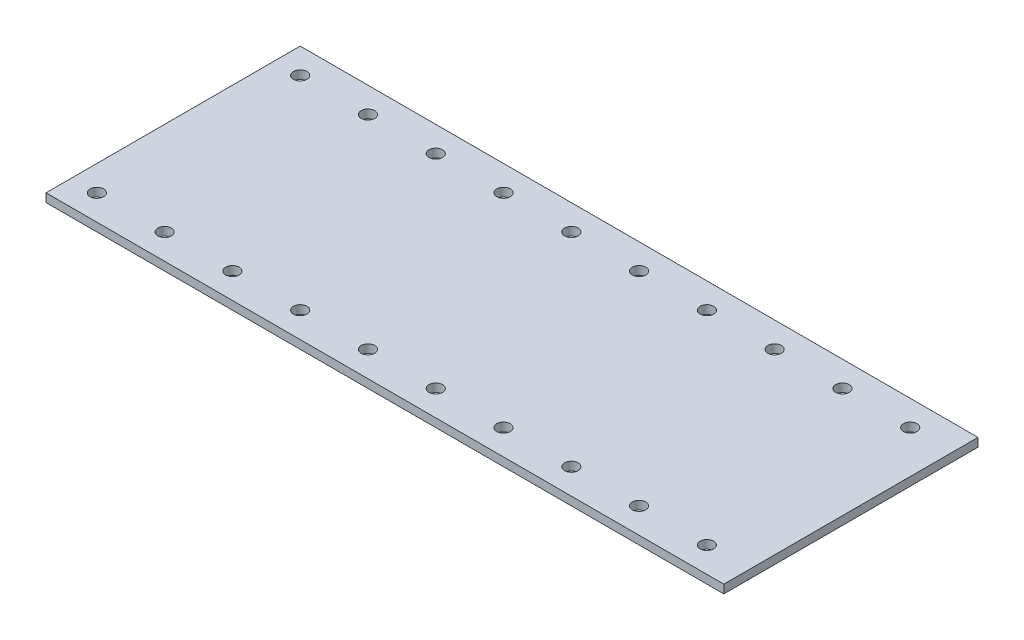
ISO-10303-21;
HEADER;
FILE_DESCRIPTION(('STEP AP214'),'2;1');
FILE_NAME('part.step','',(''),(''),'','','');
FILE_SCHEMA(('AUTOMOTIVE_DESIGN { 1 0 10303 214 1 1 1 1 }'));
ENDSEC;
DATA;
#1=APPLICATION_CONTEXT('core data for automotive mechanical design processes');
#2=APPLICATION_PROTOCOL_DEFINITION('international standard','automotive_design',2000,#1);
#3=PRODUCT_CONTEXT('',#1,'mechanical');
#4=PRODUCT('Part','Part','',(#3));
#5=PRODUCT_RELATED_PRODUCT_CATEGORY('part','',(#4));
#6=PRODUCT_DEFINITION_FORMATION('','',#4);
#7=PRODUCT_DEFINITION_CONTEXT('part definition',#1,'design');
#8=PRODUCT_DEFINITION('design','',#6,#7);
#9=PRODUCT_DEFINITION_SHAPE('','',#8);
#10=(LENGTH_UNIT() NAMED_UNIT(*) SI_UNIT(.MILLI.,.METRE.));
#11=(NAMED_UNIT(*) PLANE_ANGLE_UNIT() SI_UNIT($,.RADIAN.));
#12=(NAMED_UNIT(*) SI_UNIT($,.STERADIAN.) SOLID_ANGLE_UNIT());
#13=UNCERTAINTY_MEASURE_WITH_UNIT(LENGTH_MEASURE(1.E-05),#10,'distance_accuracy_value','');
#14=(GEOMETRIC_REPRESENTATION_CONTEXT(3) GLOBAL_UNCERTAINTY_ASSIGNED_CONTEXT((#13)) GLOBAL_UNIT_ASSIGNED_CONTEXT((#10,
#11,#12)) REPRESENTATION_CONTEXT('',''));
#15=CARTESIAN_POINT('',(0.,0.,0.));
#16=DIRECTION('',(0.,0.,1.));
#17=DIRECTION('',(1.,0.,0.));
#18=AXIS2_PLACEMENT_3D('',#15,#16,#17);
#19=CARTESIAN_POINT('',(87.5,2.5,30.));
#20=DIRECTION('',(0.,1.,0.));
#21=DIRECTION('',(0.,0.,1.));
#22=AXIS2_PLACEMENT_3D('',#19,#20,#21);
#23=CYLINDRICAL_SURFACE('',#22,2.);
#24=CARTESIAN_POINT('',(87.5,0.0250000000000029,30.));
#25=DIRECTION('',(0.,1.,0.));
#26=DIRECTION('',(0.,0.,1.));
#27=AXIS2_PLACEMENT_3D('',#24,#25,#26);
#28=CIRCLE('',#27,2.);
#29=CARTESIAN_POINT('',(87.5,0.0250000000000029,32.));
#30=VERTEX_POINT('',#29);
#31=EDGE_CURVE('E11',#30,#30,#28,.T.);
#32=ORIENTED_EDGE('',*,*,#31,.F.);
#33=EDGE_LOOP('',(#32));
#34=FACE_BOUND('',#33,.T.);
#35=CARTESIAN_POINT('',(87.5,2.5,30.));
#36=DIRECTION('',(0.,1.,0.));
#37=DIRECTION('',(0.,0.,1.));
#38=AXIS2_PLACEMENT_3D('',#35,#36,#37);
#39=CIRCLE('',#38,2.);
#40=CARTESIAN_POINT('',(87.5,2.5,32.));
#41=VERTEX_POINT('',#40);
#42=EDGE_CURVE('E255',#41,#41,#39,.T.);
#43=ORIENTED_EDGE('',*,*,#42,.T.);
#44=EDGE_LOOP('',(#43));
#45=FACE_BOUND('',#44,.T.);
#46=ADVANCED_FACE('F41',(#34,#45),#23,.F.);
#47=CARTESIAN_POINT('',(87.5,0.0250000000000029,30.));
#48=DIRECTION('',(0.,-1.,0.));
#49=DIRECTION('',(0.,0.,-1.));
#50=AXIS2_PLACEMENT_3D('',#47,#48,#49);
#51=CONICAL_SURFACE('',#50,2.,0.785398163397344);
#52=CARTESIAN_POINT('',(87.5,0.,30.));
#53=DIRECTION('',(0.,1.,0.));
#54=DIRECTION('',(0.,0.,1.));
#55=AXIS2_PLACEMENT_3D('',#52,#53,#54);
#56=CIRCLE('',#55,2.025);
#57=CARTESIAN_POINT('',(87.5,0.,32.025));
#58=VERTEX_POINT('',#57);
#59=EDGE_CURVE('E47',#58,#58,#56,.T.);
#60=ORIENTED_EDGE('',*,*,#59,.F.);
#61=EDGE_LOOP('',(#60));
#62=FACE_BOUND('',#61,.T.);
#63=ORIENTED_EDGE('',*,*,#31,.T.);
#64=EDGE_LOOP('',(#63));
#65=FACE_BOUND('',#64,.T.);
#66=ADVANCED_FACE('F261',(#62,#65),#51,.F.);
#67=CARTESIAN_POINT('',(67.5,2.5,30.));
#68=DIRECTION('',(0.,1.,0.));
#69=DIRECTION('',(0.,0.,1.));
#70=AXIS2_PLACEMENT_3D('',#67,#68,#69);
#71=CYLINDRICAL_SURFACE('',#70,2.);
#72=CARTESIAN_POINT('',(67.5,0.0250000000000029,30.));
#73=DIRECTION('',(0.,1.,0.));
#74=DIRECTION('',(0.,0.,1.));
#75=AXIS2_PLACEMENT_3D('',#72,#73,#74);
#76=CIRCLE('',#75,2.);
#77=CARTESIAN_POINT('',(67.5,0.0250000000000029,32.));
#78=VERTEX_POINT('',#77);
#79=EDGE_CURVE('E253',#78,#78,#76,.T.);
#80=ORIENTED_EDGE('',*,*,#79,.F.);
#81=EDGE_LOOP('',(#80));
#82=FACE_BOUND('',#81,.T.);
#83=CARTESIAN_POINT('',(67.5,2.5,30.));
#84=DIRECTION('',(0.,1.,0.));
#85=DIRECTION('',(0.,0.,1.));
#86=AXIS2_PLACEMENT_3D('',#83,#84,#85);
#87=CIRCLE('',#86,2.);
#88=CARTESIAN_POINT('',(67.5,2.5,32.));
#89=VERTEX_POINT('',#88);
#90=EDGE_CURVE('E244',#89,#89,#87,.T.);
#91=ORIENTED_EDGE('',*,*,#90,.T.);
#92=EDGE_LOOP('',(#91));
#93=FACE_BOUND('',#92,.T.);
#94=ADVANCED_FACE('F262',(#82,#93),#71,.F.);
#95=CARTESIAN_POINT('',(67.5,0.0250000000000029,30.));
#96=DIRECTION('',(0.,-1.,0.));
#97=DIRECTION('',(0.,0.,-1.));
#98=AXIS2_PLACEMENT_3D('',#95,#96,#97);
#99=CONICAL_SURFACE('',#98,2.,0.785398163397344);
#100=CARTESIAN_POINT('',(67.5,0.,30.));
#101=DIRECTION('',(0.,1.,0.));
#102=DIRECTION('',(0.,0.,1.));
#103=AXIS2_PLACEMENT_3D('',#100,#101,#102);
#104=CIRCLE('',#103,2.025);
#105=CARTESIAN_POINT('',(67.5,0.,32.025));
#106=VERTEX_POINT('',#105);
#107=EDGE_CURVE('E249',#106,#106,#104,.T.);
#108=ORIENTED_EDGE('',*,*,#107,.F.);
#109=EDGE_LOOP('',(#108));
#110=FACE_BOUND('',#109,.T.);
#111=ORIENTED_EDGE('',*,*,#79,.T.);
#112=EDGE_LOOP('',(#111));
#113=FACE_BOUND('',#112,.T.);
#114=ADVANCED_FACE('F410',(#110,#113),#99,.F.);
#115=CARTESIAN_POINT('',(47.5,2.5,30.));
#116=DIRECTION('',(0.,1.,0.));
#117=DIRECTION('',(0.,0.,1.));
#118=AXIS2_PLACEMENT_3D('',#115,#116,#117);
#119=CYLINDRICAL_SURFACE('',#118,2.);
#120=CARTESIAN_POINT('',(47.5,0.0250000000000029,30.));
#121=DIRECTION('',(0.,1.,0.));
#122=DIRECTION('',(0.,0.,1.));
#123=AXIS2_PLACEMENT_3D('',#120,#121,#122);
#124=CIRCLE('',#123,2.);
#125=CARTESIAN_POINT('',(47.5,0.0250000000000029,32.));
#126=VERTEX_POINT('',#125);
#127=EDGE_CURVE('E245',#126,#126,#124,.T.);
#128=ORIENTED_EDGE('',*,*,#127,.F.);
#129=EDGE_LOOP('',(#128));
#130=FACE_BOUND('',#129,.T.);
#131=CARTESIAN_POINT('',(47.5,2.5,30.));
#132=DIRECTION('',(0.,1.,0.));
#133=DIRECTION('',(0.,0.,1.));
#134=AXIS2_PLACEMENT_3D('',#131,#132,#133);
#135=CIRCLE('',#134,2.);
#136=CARTESIAN_POINT('',(47.5,2.5,32.));
#137=VERTEX_POINT('',#136);
#138=EDGE_CURVE('E237',#137,#137,#135,.T.);
#139=ORIENTED_EDGE('',*,*,#138,.T.);
#140=EDGE_LOOP('',(#139));
#141=FACE_BOUND('',#140,.T.);
#142=ADVANCED_FACE('F401',(#130,#141),#119,.F.);
#143=CARTESIAN_POINT('',(47.5,0.0250000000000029,30.));
#144=DIRECTION('',(0.,-1.,0.));
#145=DIRECTION('',(0.,0.,-1.));
#146=AXIS2_PLACEMENT_3D('',#143,#144,#145);
#147=CONICAL_SURFACE('',#146,2.,0.785398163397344);
#148=CARTESIAN_POINT('',(47.5,0.,30.));
#149=DIRECTION('',(0.,1.,0.));
#150=DIRECTION('',(0.,0.,1.));
#151=AXIS2_PLACEMENT_3D('',#148,#149,#150);
#152=CIRCLE('',#151,2.025);
#153=CARTESIAN_POINT('',(47.5,0.,32.025));
#154=VERTEX_POINT('',#153);
#155=EDGE_CURVE('E239',#154,#154,#152,.T.);
#156=ORIENTED_EDGE('',*,*,#155,.F.);
#157=EDGE_LOOP('',(#156));
#158=FACE_BOUND('',#157,.T.);
#159=ORIENTED_EDGE('',*,*,#127,.T.);
#160=EDGE_LOOP('',(#159));
#161=FACE_BOUND('',#160,.T.);
#162=ADVANCED_FACE('F398',(#158,#161),#147,.F.);
#163=CARTESIAN_POINT('',(27.5,2.5,30.));
#164=DIRECTION('',(0.,1.,0.));
#165=DIRECTION('',(0.,0.,1.));
#166=AXIS2_PLACEMENT_3D('',#163,#164,#165);
#167=CYLINDRICAL_SURFACE('',#166,2.);
#168=CARTESIAN_POINT('',(27.5,0.0250000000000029,30.));
#169=DIRECTION('',(0.,1.,0.));
#170=DIRECTION('',(0.,0.,1.));
#171=AXIS2_PLACEMENT_3D('',#168,#169,#170);
#172=CIRCLE('',#171,2.);
#173=CARTESIAN_POINT('',(27.5,0.0250000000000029,32.));
#174=VERTEX_POINT('',#173);
#175=EDGE_CURVE('E234',#174,#174,#172,.T.);
#176=ORIENTED_EDGE('',*,*,#175,.F.);
#177=EDGE_LOOP('',(#176));
#178=FACE_BOUND('',#177,.T.);
#179=CARTESIAN_POINT('',(27.5,2.5,30.));
#180=DIRECTION('',(0.,1.,0.));
#181=DIRECTION('',(0.,0.,1.));
#182=AXIS2_PLACEMENT_3D('',#179,#180,#181);
#183=CIRCLE('',#182,2.);
#184=CARTESIAN_POINT('',(27.5,2.5,32.));
#185=VERTEX_POINT('',#184);
#186=EDGE_CURVE('E230',#185,#185,#183,.T.);
#187=ORIENTED_EDGE('',*,*,#186,.T.);
#188=EDGE_LOOP('',(#187));
#189=FACE_BOUND('',#188,.T.);
#190=ADVANCED_FACE('F394',(#178,#189),#167,.F.);
#191=CARTESIAN_POINT('',(27.5,0.0250000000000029,30.));
#192=DIRECTION('',(0.,-1.,0.));
#193=DIRECTION('',(0.,0.,-1.));
#194=AXIS2_PLACEMENT_3D('',#191,#192,#193);
#195=CONICAL_SURFACE('',#194,2.,0.785398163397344);
#196=CARTESIAN_POINT('',(27.5,0.,30.));
#197=DIRECTION('',(0.,1.,0.));
#198=DIRECTION('',(0.,0.,1.));
#199=AXIS2_PLACEMENT_3D('',#196,#197,#198);
#200=CIRCLE('',#199,2.025);
#201=CARTESIAN_POINT('',(27.5,0.,32.025));
#202=VERTEX_POINT('',#201);
#203=EDGE_CURVE('E229',#202,#202,#200,.T.);
#204=ORIENTED_EDGE('',*,*,#203,.F.);
#205=EDGE_LOOP('',(#204));
#206=FACE_BOUND('',#205,.T.);
#207=ORIENTED_EDGE('',*,*,#175,.T.);
#208=EDGE_LOOP('',(#207));
#209=FACE_BOUND('',#208,.T.);
#210=ADVANCED_FACE('F391',(#206,#209),#195,.F.);
#211=CARTESIAN_POINT('',(7.49999999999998,2.5,30.));
#212=DIRECTION('',(0.,1.,0.));
#213=DIRECTION('',(0.,0.,1.));
#214=AXIS2_PLACEMENT_3D('',#211,#212,#213);
#215=CYLINDRICAL_SURFACE('',#214,2.);
#216=CARTESIAN_POINT('',(7.49999999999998,0.0250000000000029,30.));
#217=DIRECTION('',(0.,1.,0.));
#218=DIRECTION('',(0.,0.,1.));
#219=AXIS2_PLACEMENT_3D('',#216,#217,#218);
#220=CIRCLE('',#219,2.);
#221=CARTESIAN_POINT('',(7.49999999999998,0.0250000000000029,32.));
#222=VERTEX_POINT('',#221);
#223=EDGE_CURVE('E221',#222,#222,#220,.T.);
#224=ORIENTED_EDGE('',*,*,#223,.F.);
#225=EDGE_LOOP('',(#224));
#226=FACE_BOUND('',#225,.T.);
#227=CARTESIAN_POINT('',(7.49999999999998,2.5,30.));
#228=DIRECTION('',(0.,1.,0.));
#229=DIRECTION('',(0.,0.,1.));
#230=AXIS2_PLACEMENT_3D('',#227,#228,#229);
#231=CIRCLE('',#230,2.);
#232=CARTESIAN_POINT('',(7.49999999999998,2.5,32.));
#233=VERTEX_POINT('',#232);
#234=EDGE_CURVE('E217',#233,#233,#231,.T.);
#235=ORIENTED_EDGE('',*,*,#234,.T.);
#236=EDGE_LOOP('',(#235));
#237=FACE_BOUND('',#236,.T.);
#238=ADVANCED_FACE('F390',(#226,#237),#215,.F.);
#239=CARTESIAN_POINT('',(7.49999999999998,0.0250000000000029,30.));
#240=DIRECTION('',(0.,-1.,0.));
#241=DIRECTION('',(0.,0.,-1.));
#242=AXIS2_PLACEMENT_3D('',#239,#240,#241);
#243=CONICAL_SURFACE('',#242,2.,0.785398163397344);
#244=CARTESIAN_POINT('',(7.49999999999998,0.,30.));
#245=DIRECTION('',(0.,1.,0.));
#246=DIRECTION('',(0.,0.,1.));
#247=AXIS2_PLACEMENT_3D('',#244,#245,#246);
#248=CIRCLE('',#247,2.025);
#249=CARTESIAN_POINT('',(7.49999999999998,0.,32.025));
#250=VERTEX_POINT('',#249);
#251=EDGE_CURVE('E222',#250,#250,#248,.T.);
#252=ORIENTED_EDGE('',*,*,#251,.F.);
#253=EDGE_LOOP('',(#252));
#254=FACE_BOUND('',#253,.T.);
#255=ORIENTED_EDGE('',*,*,#223,.T.);
#256=EDGE_LOOP('',(#255));
#257=FACE_BOUND('',#256,.T.);
#258=ADVANCED_FACE('F382',(#254,#257),#243,.F.);
#259=CARTESIAN_POINT('',(-12.5,2.5,30.));
#260=DIRECTION('',(0.,1.,0.));
#261=DIRECTION('',(0.,0.,1.));
#262=AXIS2_PLACEMENT_3D('',#259,#260,#261);
#263=CYLINDRICAL_SURFACE('',#262,2.);
#264=CARTESIAN_POINT('',(-12.5,0.0250000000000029,30.));
#265=DIRECTION('',(0.,1.,0.));
#266=DIRECTION('',(0.,0.,1.));
#267=AXIS2_PLACEMENT_3D('',#264,#265,#266);
#268=CIRCLE('',#267,2.);
#269=CARTESIAN_POINT('',(-12.5,0.0250000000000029,32.));
#270=VERTEX_POINT('',#269);
#271=EDGE_CURVE('E214',#270,#270,#268,.T.);
#272=ORIENTED_EDGE('',*,*,#271,.F.);
#273=EDGE_LOOP('',(#272));
#274=FACE_BOUND('',#273,.T.);
#275=CARTESIAN_POINT('',(-12.5,2.5,30.));
#276=DIRECTION('',(0.,1.,0.));
#277=DIRECTION('',(0.,0.,1.));
#278=AXIS2_PLACEMENT_3D('',#275,#276,#277);
#279=CIRCLE('',#278,2.);
#280=CARTESIAN_POINT('',(-12.5,2.5,32.));
#281=VERTEX_POINT('',#280);
#282=EDGE_CURVE('E207',#281,#281,#279,.T.);
#283=ORIENTED_EDGE('',*,*,#282,.T.);
#284=EDGE_LOOP('',(#283));
#285=FACE_BOUND('',#284,.T.);
#286=ADVANCED_FACE('F377',(#274,#285),#263,.F.);
#287=CARTESIAN_POINT('',(-12.5,0.0250000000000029,30.));
#288=DIRECTION('',(0.,-1.,0.));
#289=DIRECTION('',(0.,0.,-1.));
#290=AXIS2_PLACEMENT_3D('',#287,#288,#289);
#291=CONICAL_SURFACE('',#290,2.,0.785398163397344);
#292=CARTESIAN_POINT('',(-12.5,0.,30.));
#293=DIRECTION('',(0.,1.,0.));
#294=DIRECTION('',(0.,0.,1.));
#295=AXIS2_PLACEMENT_3D('',#292,#293,#294);
#296=CIRCLE('',#295,2.025);
#297=CARTESIAN_POINT('',(-12.5,0.,32.025));
#298=VERTEX_POINT('',#297);
#299=EDGE_CURVE('E215',#298,#298,#296,.T.);
#300=ORIENTED_EDGE('',*,*,#299,.F.);
#301=EDGE_LOOP('',(#300));
#302=FACE_BOUND('',#301,.T.);
#303=ORIENTED_EDGE('',*,*,#271,.T.);
#304=EDGE_LOOP('',(#303));
#305=FACE_BOUND('',#304,.T.);
#306=ADVANCED_FACE('F374',(#302,#305),#291,.F.);
#307=CARTESIAN_POINT('',(-32.5,2.5,30.));
#308=DIRECTION('',(0.,1.,0.));
#309=DIRECTION('',(0.,0.,1.));
#310=AXIS2_PLACEMENT_3D('',#307,#308,#309);
#311=CYLINDRICAL_SURFACE('',#310,2.);
#312=CARTESIAN_POINT('',(-32.5,0.0250000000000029,30.));
#313=DIRECTION('',(0.,1.,0.));
#314=DIRECTION('',(0.,0.,1.));
#315=AXIS2_PLACEMENT_3D('',#312,#313,#314);
#316=CIRCLE('',#315,2.);
#317=CARTESIAN_POINT('',(-32.5,0.0250000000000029,32.));
#318=VERTEX_POINT('',#317);
#319=EDGE_CURVE('E206',#318,#318,#316,.T.);
#320=ORIENTED_EDGE('',*,*,#319,.F.);
#321=EDGE_LOOP('',(#320));
#322=FACE_BOUND('',#321,.T.);
#323=CARTESIAN_POINT('',(-32.5,2.5,30.));
#324=DIRECTION('',(0.,1.,0.));
#325=DIRECTION('',(0.,0.,1.));
#326=AXIS2_PLACEMENT_3D('',#323,#324,#325);
#327=CIRCLE('',#326,2.);
#328=CARTESIAN_POINT('',(-32.5,2.5,32.));
#329=VERTEX_POINT('',#328);
#330=EDGE_CURVE('E199',#329,#329,#327,.T.);
#331=ORIENTED_EDGE('',*,*,#330,.T.);
#332=EDGE_LOOP('',(#331));
#333=FACE_BOUND('',#332,.T.);
#334=ADVANCED_FACE('F371',(#322,#333),#311,.F.);
#335=CARTESIAN_POINT('',(-32.5,0.0250000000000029,30.));
#336=DIRECTION('',(0.,-1.,0.));
#337=DIRECTION('',(0.,0.,-1.));
#338=AXIS2_PLACEMENT_3D('',#335,#336,#337);
#339=CONICAL_SURFACE('',#338,2.,0.785398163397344);
#340=CARTESIAN_POINT('',(-32.5,0.,30.));
#341=DIRECTION('',(0.,1.,0.));
#342=DIRECTION('',(0.,0.,1.));
#343=AXIS2_PLACEMENT_3D('',#340,#341,#342);
#344=CIRCLE('',#343,2.025);
#345=CARTESIAN_POINT('',(-32.5,0.,32.025));
#346=VERTEX_POINT('',#345);
#347=EDGE_CURVE('E201',#346,#346,#344,.T.);
#348=ORIENTED_EDGE('',*,*,#347,.F.);
#349=EDGE_LOOP('',(#348));
#350=FACE_BOUND('',#349,.T.);
#351=ORIENTED_EDGE('',*,*,#319,.T.);
#352=EDGE_LOOP('',(#351));
#353=FACE_BOUND('',#352,.T.);
#354=ADVANCED_FACE('F370',(#350,#353),#339,.F.);
#355=CARTESIAN_POINT('',(-52.5,2.5,30.));
#356=DIRECTION('',(0.,1.,0.));
#357=DIRECTION('',(0.,0.,1.));
#358=AXIS2_PLACEMENT_3D('',#355,#356,#357);
#359=CYLINDRICAL_SURFACE('',#358,2.);
#360=CARTESIAN_POINT('',(-52.5,0.0250000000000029,30.));
#361=DIRECTION('',(0.,1.,0.));
#362=DIRECTION('',(0.,0.,1.));
#363=AXIS2_PLACEMENT_3D('',#360,#361,#362);
#364=CIRCLE('',#363,2.);
#365=CARTESIAN_POINT('',(-52.5,0.0250000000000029,32.));
#366=VERTEX_POINT('',#365);
#367=EDGE_CURVE('E197',#366,#366,#364,.T.);
#368=ORIENTED_EDGE('',*,*,#367,.F.);
#369=EDGE_LOOP('',(#368));
#370=FACE_BOUND('',#369,.T.);
#371=CARTESIAN_POINT('',(-52.5,2.5,30.));
#372=DIRECTION('',(0.,1.,0.));
#373=DIRECTION('',(0.,0.,1.));
#374=AXIS2_PLACEMENT_3D('',#371,#372,#373);
#375=CIRCLE('',#374,2.);
#376=CARTESIAN_POINT('',(-52.5,2.5,32.));
#377=VERTEX_POINT('',#376);
#378=EDGE_CURVE('E191',#377,#377,#375,.T.);
#379=ORIENTED_EDGE('',*,*,#378,.T.);
#380=EDGE_LOOP('',(#379));
#381=FACE_BOUND('',#380,.T.);
#382=ADVANCED_FACE('F361',(#370,#381),#359,.F.);
#383=CARTESIAN_POINT('',(-52.5,0.0250000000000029,30.));
#384=DIRECTION('',(0.,-1.,0.));
#385=DIRECTION('',(0.,0.,-1.));
#386=AXIS2_PLACEMENT_3D('',#383,#384,#385);
#387=CONICAL_SURFACE('',#386,2.,0.785398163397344);
#388=CARTESIAN_POINT('',(-52.5,0.,30.));
#389=DIRECTION('',(0.,1.,0.));
#390=DIRECTION('',(0.,0.,1.));
#391=AXIS2_PLACEMENT_3D('',#388,#389,#390);
#392=CIRCLE('',#391,2.025);
#393=CARTESIAN_POINT('',(-52.5,0.,32.025));
#394=VERTEX_POINT('',#393);
#395=EDGE_CURVE('E193',#394,#394,#392,.T.);
#396=ORIENTED_EDGE('',*,*,#395,.F.);
#397=EDGE_LOOP('',(#396));
#398=FACE_BOUND('',#397,.T.);
#399=ORIENTED_EDGE('',*,*,#367,.T.);
#400=EDGE_LOOP('',(#399));
#401=FACE_BOUND('',#400,.T.);
#402=ADVANCED_FACE('F358',(#398,#401),#387,.F.);
#403=CARTESIAN_POINT('',(87.5,2.5,-30.));
#404=DIRECTION('',(0.,1.,0.));
#405=DIRECTION('',(0.,0.,1.));
#406=AXIS2_PLACEMENT_3D('',#403,#404,#405);
#407=CYLINDRICAL_SURFACE('',#406,2.);
#408=CARTESIAN_POINT('',(87.5,0.0250000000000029,-30.));
#409=DIRECTION('',(0.,1.,0.));
#410=DIRECTION('',(0.,0.,1.));
#411=AXIS2_PLACEMENT_3D('',#408,#409,#410);
#412=CIRCLE('',#411,2.);
#413=CARTESIAN_POINT('',(87.5,0.0250000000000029,-28.));
#414=VERTEX_POINT('',#413);
#415=EDGE_CURVE('E187',#414,#414,#412,.T.);
#416=ORIENTED_EDGE('',*,*,#415,.F.);
#417=EDGE_LOOP('',(#416));
#418=FACE_BOUND('',#417,.T.);
#419=CARTESIAN_POINT('',(87.5,2.5,-30.));
#420=DIRECTION('',(0.,1.,0.));
#421=DIRECTION('',(0.,0.,1.));
#422=AXIS2_PLACEMENT_3D('',#419,#420,#421);
#423=CIRCLE('',#422,2.);
#424=CARTESIAN_POINT('',(87.5,2.5,-28.));
#425=VERTEX_POINT('',#424);
#426=EDGE_CURVE('E185',#425,#425,#423,.T.);
#427=ORIENTED_EDGE('',*,*,#426,.T.);
#428=EDGE_LOOP('',(#427));
#429=FACE_BOUND('',#428,.T.);
#430=ADVANCED_FACE('F354',(#418,#429),#407,.F.);
#431=CARTESIAN_POINT('',(87.5,0.0250000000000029,-30.));
#432=DIRECTION('',(0.,-1.,0.));
#433=DIRECTION('',(0.,0.,-1.));
#434=AXIS2_PLACEMENT_3D('',#431,#432,#433);
#435=CONICAL_SURFACE('',#434,2.,0.785398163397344);
#436=CARTESIAN_POINT('',(87.5,0.,-30.));
#437=DIRECTION('',(0.,1.,0.));
#438=DIRECTION('',(0.,0.,1.));
#439=AXIS2_PLACEMENT_3D('',#436,#437,#438);
#440=CIRCLE('',#439,2.025);
#441=CARTESIAN_POINT('',(87.5,0.,-27.975));
#442=VERTEX_POINT('',#441);
#443=EDGE_CURVE('E183',#442,#442,#440,.T.);
#444=ORIENTED_EDGE('',*,*,#443,.F.);
#445=EDGE_LOOP('',(#444));
#446=FACE_BOUND('',#445,.T.);
#447=ORIENTED_EDGE('',*,*,#415,.T.);
#448=EDGE_LOOP('',(#447));
#449=FACE_BOUND('',#448,.T.);
#450=ADVANCED_FACE('F351',(#446,#449),#435,.F.);
#451=CARTESIAN_POINT('',(67.5,2.5,-30.));
#452=DIRECTION('',(0.,1.,0.));
#453=DIRECTION('',(0.,0.,1.));
#454=AXIS2_PLACEMENT_3D('',#451,#452,#453);
#455=CYLINDRICAL_SURFACE('',#454,2.);
#456=CARTESIAN_POINT('',(67.5,0.0250000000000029,-30.));
#457=DIRECTION('',(0.,1.,0.));
#458=DIRECTION('',(0.,0.,1.));
#459=AXIS2_PLACEMENT_3D('',#456,#457,#458);
#460=CIRCLE('',#459,2.);
#461=CARTESIAN_POINT('',(67.5,0.0250000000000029,-28.));
#462=VERTEX_POINT('',#461);
#463=EDGE_CURVE('E178',#462,#462,#460,.T.);
#464=ORIENTED_EDGE('',*,*,#463,.F.);
#465=EDGE_LOOP('',(#464));
#466=FACE_BOUND('',#465,.T.);
#467=CARTESIAN_POINT('',(67.5,2.5,-30.));
#468=DIRECTION('',(0.,1.,0.));
#469=DIRECTION('',(0.,0.,1.));
#470=AXIS2_PLACEMENT_3D('',#467,#468,#469);
#471=CIRCLE('',#470,2.);
#472=CARTESIAN_POINT('',(67.5,2.5,-28.));
#473=VERTEX_POINT('',#472);
#474=EDGE_CURVE('E172',#473,#473,#471,.T.);
#475=ORIENTED_EDGE('',*,*,#474,.T.);
#476=EDGE_LOOP('',(#475));
#477=FACE_BOUND('',#476,.T.);
#478=ADVANCED_FACE('F350',(#466,#477),#455,.F.);
#479=CARTESIAN_POINT('',(67.5,0.0250000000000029,-30.));
#480=DIRECTION('',(0.,-1.,0.));
#481=DIRECTION('',(0.,0.,-1.));
#482=AXIS2_PLACEMENT_3D('',#479,#480,#481);
#483=CONICAL_SURFACE('',#482,2.,0.785398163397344);
#484=CARTESIAN_POINT('',(67.5,0.,-30.));
#485=DIRECTION('',(0.,1.,0.));
#486=DIRECTION('',(0.,0.,1.));
#487=AXIS2_PLACEMENT_3D('',#484,#485,#486);
#488=CIRCLE('',#487,2.025);
#489=CARTESIAN_POINT('',(67.5,0.,-27.975));
#490=VERTEX_POINT('',#489);
#491=EDGE_CURVE('E176',#490,#490,#488,.T.);
#492=ORIENTED_EDGE('',*,*,#491,.F.);
#493=EDGE_LOOP('',(#492));
#494=FACE_BOUND('',#493,.T.);
#495=ORIENTED_EDGE('',*,*,#463,.T.);
#496=EDGE_LOOP('',(#495));
#497=FACE_BOUND('',#496,.T.);
#498=ADVANCED_FACE('F344',(#494,#497),#483,.F.);
#499=CARTESIAN_POINT('',(47.5,2.5,-30.));
#500=DIRECTION('',(0.,1.,0.));
#501=DIRECTION('',(0.,0.,1.));
#502=AXIS2_PLACEMENT_3D('',#499,#500,#501);
#503=CYLINDRICAL_SURFACE('',#502,2.);
#504=CARTESIAN_POINT('',(47.5,0.0250000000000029,-30.));
#505=DIRECTION('',(0.,1.,0.));
#506=DIRECTION('',(0.,0.,1.));
#507=AXIS2_PLACEMENT_3D('',#504,#505,#506);
#508=CIRCLE('',#507,2.);
#509=CARTESIAN_POINT('',(47.5,0.0250000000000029,-28.));
#510=VERTEX_POINT('',#509);
#511=EDGE_CURVE('E168',#510,#510,#508,.T.);
#512=ORIENTED_EDGE('',*,*,#511,.F.);
#513=EDGE_LOOP('',(#512));
#514=FACE_BOUND('',#513,.T.);
#515=CARTESIAN_POINT('',(47.5,2.5,-30.));
#516=DIRECTION('',(0.,1.,0.));
#517=DIRECTION('',(0.,0.,1.));
#518=AXIS2_PLACEMENT_3D('',#515,#516,#517);
#519=CIRCLE('',#518,2.);
#520=CARTESIAN_POINT('',(47.5,2.5,-28.));
#521=VERTEX_POINT('',#520);
#522=EDGE_CURVE('E163',#521,#521,#519,.T.);
#523=ORIENTED_EDGE('',*,*,#522,.T.);
#524=EDGE_LOOP('',(#523));
#525=FACE_BOUND('',#524,.T.);
#526=ADVANCED_FACE('F338',(#514,#525),#503,.F.);
#527=CARTESIAN_POINT('',(47.5,0.0250000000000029,-30.));
#528=DIRECTION('',(0.,-1.,0.));
#529=DIRECTION('',(0.,0.,-1.));
#530=AXIS2_PLACEMENT_3D('',#527,#528,#529);
#531=CONICAL_SURFACE('',#530,2.,0.785398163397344);
#532=CARTESIAN_POINT('',(47.5,0.,-30.));
#533=DIRECTION('',(0.,1.,0.));
#534=DIRECTION('',(0.,0.,1.));
#535=AXIS2_PLACEMENT_3D('',#532,#533,#534);
#536=CIRCLE('',#535,2.025);
#537=CARTESIAN_POINT('',(47.5,0.,-27.975));
#538=VERTEX_POINT('',#537);
#539=EDGE_CURVE('E170',#538,#538,#536,.T.);
#540=ORIENTED_EDGE('',*,*,#539,.F.);
#541=EDGE_LOOP('',(#540));
#542=FACE_BOUND('',#541,.T.);
#543=ORIENTED_EDGE('',*,*,#511,.T.);
#544=EDGE_LOOP('',(#543));
#545=FACE_BOUND('',#544,.T.);
#546=ADVANCED_FACE('F333',(#542,#545),#531,.F.);
#547=CARTESIAN_POINT('',(27.5,2.5,-30.));
#548=DIRECTION('',(0.,1.,0.));
#549=DIRECTION('',(0.,0.,1.));
#550=AXIS2_PLACEMENT_3D('',#547,#548,#549);
#551=CYLINDRICAL_SURFACE('',#550,2.);
#552=CARTESIAN_POINT('',(27.5,0.0250000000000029,-30.));
#553=DIRECTION('',(0.,1.,0.));
#554=DIRECTION('',(0.,0.,1.));
#555=AXIS2_PLACEMENT_3D('',#552,#553,#554);
#556=CIRCLE('',#555,2.);
#557=CARTESIAN_POINT('',(27.5,0.0250000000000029,-28.));
#558=VERTEX_POINT('',#557);
#559=EDGE_CURVE('E161',#558,#558,#556,.T.);
#560=ORIENTED_EDGE('',*,*,#559,.F.);
#561=EDGE_LOOP('',(#560));
#562=FACE_BOUND('',#561,.T.);
#563=CARTESIAN_POINT('',(27.5,2.5,-30.));
#564=DIRECTION('',(0.,1.,0.));
#565=DIRECTION('',(0.,0.,1.));
#566=AXIS2_PLACEMENT_3D('',#563,#564,#565);
#567=CIRCLE('',#566,2.);
#568=CARTESIAN_POINT('',(27.5,2.5,-28.));
#569=VERTEX_POINT('',#568);
#570=EDGE_CURVE('E154',#569,#569,#567,.T.);
#571=ORIENTED_EDGE('',*,*,#570,.T.);
#572=EDGE_LOOP('',(#571));
#573=FACE_BOUND('',#572,.T.);
#574=ADVANCED_FACE('F332',(#562,#573),#551,.F.);
#575=CARTESIAN_POINT('',(27.5,0.0250000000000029,-30.));
#576=DIRECTION('',(0.,-1.,0.));
#577=DIRECTION('',(0.,0.,-1.));
#578=AXIS2_PLACEMENT_3D('',#575,#576,#577);
#579=CONICAL_SURFACE('',#578,2.,0.785398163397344);
#580=CARTESIAN_POINT('',(27.5,0.,-30.));
#581=DIRECTION('',(0.,1.,0.));
#582=DIRECTION('',(0.,0.,1.));
#583=AXIS2_PLACEMENT_3D('',#580,#581,#582);
#584=CIRCLE('',#583,2.025);
#585=CARTESIAN_POINT('',(27.5,0.,-27.975));
#586=VERTEX_POINT('',#585);
#587=EDGE_CURVE('E158',#586,#586,#584,.T.);
#588=ORIENTED_EDGE('',*,*,#587,.F.);
#589=EDGE_LOOP('',(#588));
#590=FACE_BOUND('',#589,.T.);
#591=ORIENTED_EDGE('',*,*,#559,.T.);
#592=EDGE_LOOP('',(#591));
#593=FACE_BOUND('',#592,.T.);
#594=ADVANCED_FACE('F330',(#590,#593),#579,.F.);
#595=CARTESIAN_POINT('',(7.49999999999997,2.5,-30.));
#596=DIRECTION('',(0.,1.,0.));
#597=DIRECTION('',(0.,0.,1.));
#598=AXIS2_PLACEMENT_3D('',#595,#596,#597);
#599=CYLINDRICAL_SURFACE('',#598,2.);
#600=CARTESIAN_POINT('',(7.49999999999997,0.0250000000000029,-30.));
#601=DIRECTION('',(0.,1.,0.));
#602=DIRECTION('',(0.,0.,1.));
#603=AXIS2_PLACEMENT_3D('',#600,#601,#602);
#604=CIRCLE('',#603,2.);
#605=CARTESIAN_POINT('',(7.49999999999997,0.0250000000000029,-28.));
#606=VERTEX_POINT('',#605);
#607=EDGE_CURVE('E155',#606,#606,#604,.T.);
#608=ORIENTED_EDGE('',*,*,#607,.F.);
#609=EDGE_LOOP('',(#608));
#610=FACE_BOUND('',#609,.T.);
#611=CARTESIAN_POINT('',(7.49999999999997,2.5,-30.));
#612=DIRECTION('',(0.,1.,0.));
#613=DIRECTION('',(0.,0.,1.));
#614=AXIS2_PLACEMENT_3D('',#611,#612,#613);
#615=CIRCLE('',#614,2.);
#616=CARTESIAN_POINT('',(7.49999999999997,2.5,-28.));
#617=VERTEX_POINT('',#616);
#618=EDGE_CURVE('E148',#617,#617,#615,.T.);
#619=ORIENTED_EDGE('',*,*,#618,.T.);
#620=EDGE_LOOP('',(#619));
#621=FACE_BOUND('',#620,.T.);
#622=ADVANCED_FACE('F323',(#610,#621),#599,.F.);
#623=CARTESIAN_POINT('',(7.49999999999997,0.0250000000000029,-30.));
#624=DIRECTION('',(0.,-1.,0.));
#625=DIRECTION('',(0.,0.,-1.));
#626=AXIS2_PLACEMENT_3D('',#623,#624,#625);
#627=CONICAL_SURFACE('',#626,2.,0.785398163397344);
#628=CARTESIAN_POINT('',(7.49999999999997,0.,-30.));
#629=DIRECTION('',(0.,1.,0.));
#630=DIRECTION('',(0.,0.,1.));
#631=AXIS2_PLACEMENT_3D('',#628,#629,#630);
#632=CIRCLE('',#631,2.025);
#633=CARTESIAN_POINT('',(7.49999999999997,0.,-27.975));
#634=VERTEX_POINT('',#633);
#635=EDGE_CURVE('E149',#634,#634,#632,.T.);
#636=ORIENTED_EDGE('',*,*,#635,.F.);
#637=EDGE_LOOP('',(#636));
#638=FACE_BOUND('',#637,.T.);
#639=ORIENTED_EDGE('',*,*,#607,.T.);
#640=EDGE_LOOP('',(#639));
#641=FACE_BOUND('',#640,.T.);
#642=ADVANCED_FACE('F317',(#638,#641),#627,.F.);
#643=CARTESIAN_POINT('',(-12.5,2.5,-30.));
#644=DIRECTION('',(0.,1.,0.));
#645=DIRECTION('',(0.,0.,1.));
#646=AXIS2_PLACEMENT_3D('',#643,#644,#645);
#647=CYLINDRICAL_SURFACE('',#646,2.);
#648=CARTESIAN_POINT('',(-12.5,0.0250000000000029,-30.));
#649=DIRECTION('',(0.,1.,0.));
#650=DIRECTION('',(0.,0.,1.));
#651=AXIS2_PLACEMENT_3D('',#648,#649,#650);
#652=CIRCLE('',#651,2.);
#653=CARTESIAN_POINT('',(-12.5,0.0250000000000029,-28.));
#654=VERTEX_POINT('',#653);
#655=EDGE_CURVE('E141',#654,#654,#652,.T.);
#656=ORIENTED_EDGE('',*,*,#655,.F.);
#657=EDGE_LOOP('',(#656));
#658=FACE_BOUND('',#657,.T.);
#659=CARTESIAN_POINT('',(-12.5,2.5,-30.));
#660=DIRECTION('',(0.,1.,0.));
#661=DIRECTION('',(0.,0.,1.));
#662=AXIS2_PLACEMENT_3D('',#659,#660,#661);
#663=CIRCLE('',#662,2.);
#664=CARTESIAN_POINT('',(-12.5,2.5,-28.));
#665=VERTEX_POINT('',#664);
#666=EDGE_CURVE('E137',#665,#665,#663,.T.);
#667=ORIENTED_EDGE('',*,*,#666,.T.);
#668=EDGE_LOOP('',(#667));
#669=FACE_BOUND('',#668,.T.);
#670=ADVANCED_FACE('F312',(#658,#669),#647,.F.);
#671=CARTESIAN_POINT('',(-12.5,0.0250000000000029,-30.));
#672=DIRECTION('',(0.,-1.,0.));
#673=DIRECTION('',(0.,0.,-1.));
#674=AXIS2_PLACEMENT_3D('',#671,#672,#673);
#675=CONICAL_SURFACE('',#674,2.,0.785398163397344);
#676=CARTESIAN_POINT('',(-12.5,0.,-30.));
#677=DIRECTION('',(0.,1.,0.));
#678=DIRECTION('',(0.,0.,1.));
#679=AXIS2_PLACEMENT_3D('',#676,#677,#678);
#680=CIRCLE('',#679,2.025);
#681=CARTESIAN_POINT('',(-12.5,0.,-27.975));
#682=VERTEX_POINT('',#681);
#683=EDGE_CURVE('E140',#682,#682,#680,.T.);
#684=ORIENTED_EDGE('',*,*,#683,.F.);
#685=EDGE_LOOP('',(#684));
#686=FACE_BOUND('',#685,.T.);
#687=ORIENTED_EDGE('',*,*,#655,.T.);
#688=EDGE_LOOP('',(#687));
#689=FACE_BOUND('',#688,.T.);
#690=ADVANCED_FACE('F313',(#686,#689),#675,.F.);
#691=CARTESIAN_POINT('',(-32.5,2.5,-30.));
#692=DIRECTION('',(0.,1.,0.));
#693=DIRECTION('',(0.,0.,1.));
#694=AXIS2_PLACEMENT_3D('',#691,#692,#693);
#695=CYLINDRICAL_SURFACE('',#694,2.);
#696=CARTESIAN_POINT('',(-32.5,0.0250000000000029,-30.));
#697=DIRECTION('',(0.,1.,0.));
#698=DIRECTION('',(0.,0.,1.));
#699=AXIS2_PLACEMENT_3D('',#696,#697,#698);
#700=CIRCLE('',#699,2.);
#701=CARTESIAN_POINT('',(-32.5,0.0250000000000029,-28.));
#702=VERTEX_POINT('',#701);
#703=EDGE_CURVE('E133',#702,#702,#700,.T.);
#704=ORIENTED_EDGE('',*,*,#703,.F.);
#705=EDGE_LOOP('',(#704));
#706=FACE_BOUND('',#705,.T.);
#707=CARTESIAN_POINT('',(-32.5,2.5,-30.));
#708=DIRECTION('',(0.,1.,0.));
#709=DIRECTION('',(0.,0.,1.));
#710=AXIS2_PLACEMENT_3D('',#707,#708,#709);
#711=CIRCLE('',#710,2.);
#712=CARTESIAN_POINT('',(-32.5,2.5,-28.));
#713=VERTEX_POINT('',#712);
#714=EDGE_CURVE('E126',#713,#713,#711,.T.);
#715=ORIENTED_EDGE('',*,*,#714,.T.);
#716=EDGE_LOOP('',(#715));
#717=FACE_BOUND('',#716,.T.);
#718=ADVANCED_FACE('F307',(#706,#717),#695,.F.);
#719=CARTESIAN_POINT('',(-32.5,0.0250000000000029,-30.));
#720=DIRECTION('',(0.,-1.,0.));
#721=DIRECTION('',(0.,0.,-1.));
#722=AXIS2_PLACEMENT_3D('',#719,#720,#721);
#723=CONICAL_SURFACE('',#722,2.,0.785398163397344);
#724=CARTESIAN_POINT('',(-32.5,0.,-30.));
#725=DIRECTION('',(0.,1.,0.));
#726=DIRECTION('',(0.,0.,1.));
#727=AXIS2_PLACEMENT_3D('',#724,#725,#726);
#728=CIRCLE('',#727,2.025);
#729=CARTESIAN_POINT('',(-32.5,0.,-27.975));
#730=VERTEX_POINT('',#729);
#731=EDGE_CURVE('E131',#730,#730,#728,.T.);
#732=ORIENTED_EDGE('',*,*,#731,.F.);
#733=EDGE_LOOP('',(#732));
#734=FACE_BOUND('',#733,.T.);
#735=ORIENTED_EDGE('',*,*,#703,.T.);
#736=EDGE_LOOP('',(#735));
#737=FACE_BOUND('',#736,.T.);
#738=ADVANCED_FACE('F304',(#734,#737),#723,.F.);
#739=CARTESIAN_POINT('',(-52.5,2.5,-30.));
#740=DIRECTION('',(0.,1.,0.));
#741=DIRECTION('',(0.,0.,1.));
#742=AXIS2_PLACEMENT_3D('',#739,#740,#741);
#743=CYLINDRICAL_SURFACE('',#742,2.);
#744=CARTESIAN_POINT('',(-52.5,0.0250000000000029,-30.));
#745=DIRECTION('',(0.,1.,0.));
#746=DIRECTION('',(0.,0.,1.));
#747=AXIS2_PLACEMENT_3D('',#744,#745,#746);
#748=CIRCLE('',#747,2.);
#749=CARTESIAN_POINT('',(-52.5,0.0250000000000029,-28.));
#750=VERTEX_POINT('',#749);
#751=EDGE_CURVE('E125',#750,#750,#748,.T.);
#752=ORIENTED_EDGE('',*,*,#751,.F.);
#753=EDGE_LOOP('',(#752));
#754=FACE_BOUND('',#753,.T.);
#755=CARTESIAN_POINT('',(-52.5,2.5,-30.));
#756=DIRECTION('',(0.,1.,0.));
#757=DIRECTION('',(0.,0.,1.));
#758=AXIS2_PLACEMENT_3D('',#755,#756,#757);
#759=CIRCLE('',#758,2.);
#760=CARTESIAN_POINT('',(-52.5,2.5,-28.));
#761=VERTEX_POINT('',#760);
#762=EDGE_CURVE('E118',#761,#761,#759,.T.);
#763=ORIENTED_EDGE('',*,*,#762,.T.);
#764=EDGE_LOOP('',(#763));
#765=FACE_BOUND('',#764,.T.);
#766=ADVANCED_FACE('F298',(#754,#765),#743,.F.);
#767=CARTESIAN_POINT('',(-52.5,0.0250000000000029,-30.));
#768=DIRECTION('',(0.,-1.,0.));
#769=DIRECTION('',(0.,0.,-1.));
#770=AXIS2_PLACEMENT_3D('',#767,#768,#769);
#771=CONICAL_SURFACE('',#770,2.,0.785398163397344);
#772=CARTESIAN_POINT('',(-52.5,0.,-30.));
#773=DIRECTION('',(0.,1.,0.));
#774=DIRECTION('',(0.,0.,1.));
#775=AXIS2_PLACEMENT_3D('',#772,#773,#774);
#776=CIRCLE('',#775,2.025);
#777=CARTESIAN_POINT('',(-52.5,0.,-27.975));
#778=VERTEX_POINT('',#777);
#779=EDGE_CURVE('E122',#778,#778,#776,.T.);
#780=ORIENTED_EDGE('',*,*,#779,.F.);
#781=EDGE_LOOP('',(#780));
#782=FACE_BOUND('',#781,.T.);
#783=ORIENTED_EDGE('',*,*,#751,.T.);
#784=EDGE_LOOP('',(#783));
#785=FACE_BOUND('',#784,.T.);
#786=ADVANCED_FACE('F296',(#782,#785),#771,.F.);
#787=CARTESIAN_POINT('',(100.,2.5,-37.5));
#788=DIRECTION('',(-1.,0.,0.));
#789=DIRECTION('',(0.,0.,1.));
#790=AXIS2_PLACEMENT_3D('',#787,#788,#789);
#791=PLANE('',#790);
#792=DIRECTION('',(0.,0.,-1.));
#793=VECTOR('',#792,1.);
#794=CARTESIAN_POINT('',(100.,0.,-37.5));
#795=LINE('',#794,#793);
#796=CARTESIAN_POINT('',(100.,0.,37.5));
#797=VERTEX_POINT('',#796);
#798=CARTESIAN_POINT('',(100.,0.,-37.5));
#799=VERTEX_POINT('',#798);
#800=EDGE_CURVE('E108',#797,#799,#795,.T.);
#801=ORIENTED_EDGE('',*,*,#800,.T.);
#802=DIRECTION('',(0.,-1.,0.));
#803=VECTOR('',#802,1.);
#804=CARTESIAN_POINT('',(100.,2.5,-37.5));
#805=LINE('',#804,#803);
#806=CARTESIAN_POINT('',(100.,2.5,-37.5));
#807=VERTEX_POINT('',#806);
#808=EDGE_CURVE('E99',#807,#799,#805,.T.);
#809=ORIENTED_EDGE('',*,*,#808,.F.);
#810=DIRECTION('',(0.,0.,-1.));
#811=VECTOR('',#810,1.);
#812=CARTESIAN_POINT('',(100.,2.5,-37.5));
#813=LINE('',#812,#811);
#814=CARTESIAN_POINT('',(100.,2.5,37.5));
#815=VERTEX_POINT('',#814);
#816=EDGE_CURVE('E94',#815,#807,#813,.T.);
#817=ORIENTED_EDGE('',*,*,#816,.F.);
#818=DIRECTION('',(0.,-1.,0.));
#819=VECTOR('',#818,1.);
#820=CARTESIAN_POINT('',(100.,2.5,37.5));
#821=LINE('',#820,#819);
#822=EDGE_CURVE('E104',#815,#797,#821,.T.);
#823=ORIENTED_EDGE('',*,*,#822,.T.);
#824=EDGE_LOOP('',(#801,#809,#817,#823));
#825=FACE_BOUND('',#824,.T.);
#826=ADVANCED_FACE('F291',(#825),#791,.F.);
#827=CARTESIAN_POINT('',(-100.,2.5,-37.5));
#828=DIRECTION('',(0.,0.,1.));
#829=DIRECTION('',(1.,0.,0.));
#830=AXIS2_PLACEMENT_3D('',#827,#828,#829);
#831=PLANE('',#830);
#832=DIRECTION('',(-1.,0.,0.));
#833=VECTOR('',#832,1.);
#834=CARTESIAN_POINT('',(-100.,0.,-37.5));
#835=LINE('',#834,#833);
#836=CARTESIAN_POINT('',(-100.,0.,-37.5));
#837=VERTEX_POINT('',#836);
#838=EDGE_CURVE('E97',#799,#837,#835,.T.);
#839=ORIENTED_EDGE('',*,*,#838,.T.);
#840=DIRECTION('',(0.,-1.,0.));
#841=VECTOR('',#840,1.);
#842=CARTESIAN_POINT('',(-100.,2.5,-37.5));
#843=LINE('',#842,#841);
#844=CARTESIAN_POINT('',(-100.,2.5,-37.5));
#845=VERTEX_POINT('',#844);
#846=EDGE_CURVE('E100',#845,#837,#843,.T.);
#847=ORIENTED_EDGE('',*,*,#846,.F.);
#848=DIRECTION('',(-1.,0.,0.));
#849=VECTOR('',#848,1.);
#850=CARTESIAN_POINT('',(-100.,2.5,-37.5));
#851=LINE('',#850,#849);
#852=EDGE_CURVE('E86',#807,#845,#851,.T.);
#853=ORIENTED_EDGE('',*,*,#852,.F.);
#854=ORIENTED_EDGE('',*,*,#808,.T.);
#855=EDGE_LOOP('',(#839,#847,#853,#854));
#856=FACE_BOUND('',#855,.T.);
#857=ADVANCED_FACE('F98',(#856),#831,.F.);
#858=CARTESIAN_POINT('',(-100.,2.5,-37.5));
#859=DIRECTION('',(1.,0.,0.));
#860=DIRECTION('',(0.,0.,-1.));
#861=AXIS2_PLACEMENT_3D('',#858,#859,#860);
#862=PLANE('',#861);
#863=DIRECTION('',(0.,0.,1.));
#864=VECTOR('',#863,1.);
#865=CARTESIAN_POINT('',(-100.,0.,-37.5));
#866=LINE('',#865,#864);
#867=CARTESIAN_POINT('',(-100.,0.,37.5));
#868=VERTEX_POINT('',#867);
#869=EDGE_CURVE('E74',#837,#868,#866,.T.);
#870=ORIENTED_EDGE('',*,*,#869,.T.);
#871=DIRECTION('',(0.,-1.,0.));
#872=VECTOR('',#871,1.);
#873=CARTESIAN_POINT('',(-100.,2.5,37.5));
#874=LINE('',#873,#872);
#875=CARTESIAN_POINT('',(-100.,2.5,37.5));
#876=VERTEX_POINT('',#875);
#877=EDGE_CURVE('E101',#876,#868,#874,.T.);
#878=ORIENTED_EDGE('',*,*,#877,.F.);
#879=DIRECTION('',(0.,0.,1.));
#880=VECTOR('',#879,1.);
#881=CARTESIAN_POINT('',(-100.,2.5,-37.5));
#882=LINE('',#881,#880);
#883=EDGE_CURVE('E95',#845,#876,#882,.T.);
#884=ORIENTED_EDGE('',*,*,#883,.F.);
#885=ORIENTED_EDGE('',*,*,#846,.T.);
#886=EDGE_LOOP('',(#870,#878,#884,#885));
#887=FACE_BOUND('',#886,.T.);
#888=ADVANCED_FACE('F103',(#887),#862,.F.);
#889=CARTESIAN_POINT('',(-100.,2.5,37.5));
#890=DIRECTION('',(0.,0.,-1.));
#891=DIRECTION('',(-1.,0.,0.));
#892=AXIS2_PLACEMENT_3D('',#889,#890,#891);
#893=PLANE('',#892);
#894=DIRECTION('',(1.,0.,0.));
#895=VECTOR('',#894,1.);
#896=CARTESIAN_POINT('',(-100.,0.,37.5));
#897=LINE('',#896,#895);
#898=EDGE_CURVE('E79',#868,#797,#897,.T.);
#899=ORIENTED_EDGE('',*,*,#898,.T.);
#900=ORIENTED_EDGE('',*,*,#822,.F.);
#901=DIRECTION('',(1.,0.,0.));
#902=VECTOR('',#901,1.);
#903=CARTESIAN_POINT('',(-100.,2.5,37.5));
#904=LINE('',#903,#902);
#905=EDGE_CURVE('E60',#876,#815,#904,.T.);
#906=ORIENTED_EDGE('',*,*,#905,.F.);
#907=ORIENTED_EDGE('',*,*,#877,.T.);
#908=EDGE_LOOP('',(#899,#900,#906,#907));
#909=FACE_BOUND('',#908,.T.);
#910=ADVANCED_FACE('F275',(#909),#893,.F.);
#911=CARTESIAN_POINT('',(0.,2.5,0.));
#912=DIRECTION('',(0.,1.,0.));
#913=DIRECTION('',(0.,0.,1.));
#914=AXIS2_PLACEMENT_3D('',#911,#912,#913);
#915=PLANE('',#914);
#916=CARTESIAN_POINT('',(-72.5,2.5,30.));
#917=DIRECTION('',(0.,1.,0.));
#918=DIRECTION('',(0.,0.,1.));
#919=AXIS2_PLACEMENT_3D('',#916,#917,#918);
#920=CIRCLE('',#919,2.);
#921=CARTESIAN_POINT('',(-72.5,2.5,32.));
#922=VERTEX_POINT('',#921);
#923=EDGE_CURVE('E630',#922,#922,#920,.T.);
#924=ORIENTED_EDGE('',*,*,#923,.F.);
#925=EDGE_LOOP('',(#924));
#926=FACE_BOUND('',#925,.T.);
#927=CARTESIAN_POINT('',(-72.5,2.5,-30.));
#928=DIRECTION('',(0.,1.,0.));
#929=DIRECTION('',(0.,0.,1.));
#930=AXIS2_PLACEMENT_3D('',#927,#928,#929);
#931=CIRCLE('',#930,2.);
#932=CARTESIAN_POINT('',(-72.5,2.5,-28.));
#933=VERTEX_POINT('',#932);
#934=EDGE_CURVE('E619',#933,#933,#931,.T.);
#935=ORIENTED_EDGE('',*,*,#934,.F.);
#936=EDGE_LOOP('',(#935));
#937=FACE_BOUND('',#936,.T.);
#938=CARTESIAN_POINT('',(-92.5,2.5,-30.));
#939=DIRECTION('',(0.,1.,0.));
#940=DIRECTION('',(0.,0.,1.));
#941=AXIS2_PLACEMENT_3D('',#938,#939,#940);
#942=CIRCLE('',#941,2.);
#943=CARTESIAN_POINT('',(-92.5,2.5,-28.));
#944=VERTEX_POINT('',#943);
#945=EDGE_CURVE('E607',#944,#944,#942,.T.);
#946=ORIENTED_EDGE('',*,*,#945,.F.);
#947=EDGE_LOOP('',(#946));
#948=FACE_BOUND('',#947,.T.);
#949=CARTESIAN_POINT('',(-92.5,2.5,30.));
#950=DIRECTION('',(0.,1.,0.));
#951=DIRECTION('',(0.,0.,1.));
#952=AXIS2_PLACEMENT_3D('',#949,#950,#951);
#953=CIRCLE('',#952,2.);
#954=CARTESIAN_POINT('',(-92.5,2.5,32.));
#955=VERTEX_POINT('',#954);
#956=EDGE_CURVE('E594',#955,#955,#953,.T.);
#957=ORIENTED_EDGE('',*,*,#956,.F.);
#958=EDGE_LOOP('',(#957));
#959=FACE_BOUND('',#958,.T.);
#960=ORIENTED_EDGE('',*,*,#816,.T.);
#961=ORIENTED_EDGE('',*,*,#852,.T.);
#962=ORIENTED_EDGE('',*,*,#883,.T.);
#963=ORIENTED_EDGE('',*,*,#905,.T.);
#964=EDGE_LOOP('',(#960,#961,#962,#963));
#965=FACE_BOUND('',#964,.T.);
#966=ORIENTED_EDGE('',*,*,#762,.F.);
#967=EDGE_LOOP('',(#966));
#968=FACE_BOUND('',#967,.T.);
#969=ORIENTED_EDGE('',*,*,#714,.F.);
#970=EDGE_LOOP('',(#969));
#971=FACE_BOUND('',#970,.T.);
#972=ORIENTED_EDGE('',*,*,#666,.F.);
#973=EDGE_LOOP('',(#972));
#974=FACE_BOUND('',#973,.T.);
#975=ORIENTED_EDGE('',*,*,#618,.F.);
#976=EDGE_LOOP('',(#975));
#977=FACE_BOUND('',#976,.T.);
#978=ORIENTED_EDGE('',*,*,#570,.F.);
#979=EDGE_LOOP('',(#978));
#980=FACE_BOUND('',#979,.T.);
#981=ORIENTED_EDGE('',*,*,#522,.F.);
#982=EDGE_LOOP('',(#981));
#983=FACE_BOUND('',#982,.T.);
#984=ORIENTED_EDGE('',*,*,#474,.F.);
#985=EDGE_LOOP('',(#984));
#986=FACE_BOUND('',#985,.T.);
#987=ORIENTED_EDGE('',*,*,#426,.F.);
#988=EDGE_LOOP('',(#987));
#989=FACE_BOUND('',#988,.T.);
#990=ORIENTED_EDGE('',*,*,#378,.F.);
#991=EDGE_LOOP('',(#990));
#992=FACE_BOUND('',#991,.T.);
#993=ORIENTED_EDGE('',*,*,#330,.F.);
#994=EDGE_LOOP('',(#993));
#995=FACE_BOUND('',#994,.T.);
#996=ORIENTED_EDGE('',*,*,#282,.F.);
#997=EDGE_LOOP('',(#996));
#998=FACE_BOUND('',#997,.T.);
#999=ORIENTED_EDGE('',*,*,#234,.F.);
#1000=EDGE_LOOP('',(#999));
#1001=FACE_BOUND('',#1000,.T.);
#1002=ORIENTED_EDGE('',*,*,#186,.F.);
#1003=EDGE_LOOP('',(#1002));
#1004=FACE_BOUND('',#1003,.T.);
#1005=ORIENTED_EDGE('',*,*,#138,.F.);
#1006=EDGE_LOOP('',(#1005));
#1007=FACE_BOUND('',#1006,.T.);
#1008=ORIENTED_EDGE('',*,*,#90,.F.);
#1009=EDGE_LOOP('',(#1008));
#1010=FACE_BOUND('',#1009,.T.);
#1011=ORIENTED_EDGE('',*,*,#42,.F.);
#1012=EDGE_LOOP('',(#1011));
#1013=FACE_BOUND('',#1012,.T.);
#1014=ADVANCED_FACE('F90',(#926,#937,#948,#959,#965,#968,#971,#974,#977,#980,#983,#986,#989,
#992,#995,#998,#1001,#1004,#1007,#1010,#1013),#915,.T.);
#1015=CARTESIAN_POINT('',(0.,0.,0.));
#1016=DIRECTION('',(0.,1.,0.));
#1017=DIRECTION('',(0.,0.,1.));
#1018=AXIS2_PLACEMENT_3D('',#1015,#1016,#1017);
#1019=PLANE('',#1018);
#1020=CARTESIAN_POINT('',(-72.5,0.,30.));
#1021=DIRECTION('',(0.,1.,0.));
#1022=DIRECTION('',(0.,0.,1.));
#1023=AXIS2_PLACEMENT_3D('',#1020,#1021,#1022);
#1024=CIRCLE('',#1023,2.025);
#1025=CARTESIAN_POINT('',(-72.5,0.,32.025));
#1026=VERTEX_POINT('',#1025);
#1027=EDGE_CURVE('E624',#1026,#1026,#1024,.T.);
#1028=ORIENTED_EDGE('',*,*,#1027,.T.);
#1029=EDGE_LOOP('',(#1028));
#1030=FACE_BOUND('',#1029,.T.);
#1031=CARTESIAN_POINT('',(-72.5,0.,-30.));
#1032=DIRECTION('',(0.,1.,0.));
#1033=DIRECTION('',(0.,0.,1.));
#1034=AXIS2_PLACEMENT_3D('',#1031,#1032,#1033);
#1035=CIRCLE('',#1034,2.025);
#1036=CARTESIAN_POINT('',(-72.5,0.,-27.975));
#1037=VERTEX_POINT('',#1036);
#1038=EDGE_CURVE('E614',#1037,#1037,#1035,.T.);
#1039=ORIENTED_EDGE('',*,*,#1038,.T.);
#1040=EDGE_LOOP('',(#1039));
#1041=FACE_BOUND('',#1040,.T.);
#1042=CARTESIAN_POINT('',(-92.5,0.,-30.));
#1043=DIRECTION('',(0.,1.,0.));
#1044=DIRECTION('',(0.,0.,1.));
#1045=AXIS2_PLACEMENT_3D('',#1042,#1043,#1044);
#1046=CIRCLE('',#1045,2.025);
#1047=CARTESIAN_POINT('',(-92.5,0.,-27.975));
#1048=VERTEX_POINT('',#1047);
#1049=EDGE_CURVE('E606',#1048,#1048,#1046,.T.);
#1050=ORIENTED_EDGE('',*,*,#1049,.T.);
#1051=EDGE_LOOP('',(#1050));
#1052=FACE_BOUND('',#1051,.T.);
#1053=CARTESIAN_POINT('',(-92.5,0.,30.));
#1054=DIRECTION('',(0.,1.,0.));
#1055=DIRECTION('',(0.,0.,1.));
#1056=AXIS2_PLACEMENT_3D('',#1053,#1054,#1055);
#1057=CIRCLE('',#1056,2.025);
#1058=CARTESIAN_POINT('',(-92.5,0.,32.025));
#1059=VERTEX_POINT('',#1058);
#1060=EDGE_CURVE('E600',#1059,#1059,#1057,.T.);
#1061=ORIENTED_EDGE('',*,*,#1060,.T.);
#1062=EDGE_LOOP('',(#1061));
#1063=FACE_BOUND('',#1062,.T.);
#1064=ORIENTED_EDGE('',*,*,#800,.F.);
#1065=ORIENTED_EDGE('',*,*,#898,.F.);
#1066=ORIENTED_EDGE('',*,*,#869,.F.);
#1067=ORIENTED_EDGE('',*,*,#838,.F.);
#1068=EDGE_LOOP('',(#1064,#1065,#1066,#1067));
#1069=FACE_BOUND('',#1068,.T.);
#1070=ORIENTED_EDGE('',*,*,#779,.T.);
#1071=EDGE_LOOP('',(#1070));
#1072=FACE_BOUND('',#1071,.T.);
#1073=ORIENTED_EDGE('',*,*,#731,.T.);
#1074=EDGE_LOOP('',(#1073));
#1075=FACE_BOUND('',#1074,.T.);
#1076=ORIENTED_EDGE('',*,*,#683,.T.);
#1077=EDGE_LOOP('',(#1076));
#1078=FACE_BOUND('',#1077,.T.);
#1079=ORIENTED_EDGE('',*,*,#635,.T.);
#1080=EDGE_LOOP('',(#1079));
#1081=FACE_BOUND('',#1080,.T.);
#1082=ORIENTED_EDGE('',*,*,#587,.T.);
#1083=EDGE_LOOP('',(#1082));
#1084=FACE_BOUND('',#1083,.T.);
#1085=ORIENTED_EDGE('',*,*,#539,.T.);
#1086=EDGE_LOOP('',(#1085));
#1087=FACE_BOUND('',#1086,.T.);
#1088=ORIENTED_EDGE('',*,*,#491,.T.);
#1089=EDGE_LOOP('',(#1088));
#1090=FACE_BOUND('',#1089,.T.);
#1091=ORIENTED_EDGE('',*,*,#443,.T.);
#1092=EDGE_LOOP('',(#1091));
#1093=FACE_BOUND('',#1092,.T.);
#1094=ORIENTED_EDGE('',*,*,#395,.T.);
#1095=EDGE_LOOP('',(#1094));
#1096=FACE_BOUND('',#1095,.T.);
#1097=ORIENTED_EDGE('',*,*,#347,.T.);
#1098=EDGE_LOOP('',(#1097));
#1099=FACE_BOUND('',#1098,.T.);
#1100=ORIENTED_EDGE('',*,*,#299,.T.);
#1101=EDGE_LOOP('',(#1100));
#1102=FACE_BOUND('',#1101,.T.);
#1103=ORIENTED_EDGE('',*,*,#251,.T.);
#1104=EDGE_LOOP('',(#1103));
#1105=FACE_BOUND('',#1104,.T.);
#1106=ORIENTED_EDGE('',*,*,#203,.T.);
#1107=EDGE_LOOP('',(#1106));
#1108=FACE_BOUND('',#1107,.T.);
#1109=ORIENTED_EDGE('',*,*,#155,.T.);
#1110=EDGE_LOOP('',(#1109));
#1111=FACE_BOUND('',#1110,.T.);
#1112=ORIENTED_EDGE('',*,*,#107,.T.);
#1113=EDGE_LOOP('',(#1112));
#1114=FACE_BOUND('',#1113,.T.);
#1115=ORIENTED_EDGE('',*,*,#59,.T.);
#1116=EDGE_LOOP('',(#1115));
#1117=FACE_BOUND('',#1116,.T.);
#1118=ADVANCED_FACE('F259',(#1030,#1041,#1052,#1063,#1069,#1072,#1075,#1078,#1081,#1084,#1087,
#1090,#1093,#1096,#1099,#1102,#1105,#1108,#1111,#1114,#1117),#1019,.F.);
#1119=CARTESIAN_POINT('',(-92.5,0.0250000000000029,30.));
#1120=DIRECTION('',(0.,-1.,0.));
#1121=DIRECTION('',(0.,0.,-1.));
#1122=AXIS2_PLACEMENT_3D('',#1119,#1120,#1121);
#1123=CONICAL_SURFACE('',#1122,2.,0.785398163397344);
#1124=ORIENTED_EDGE('',*,*,#1060,.F.);
#1125=EDGE_LOOP('',(#1124));
#1126=FACE_BOUND('',#1125,.T.);
#1127=CARTESIAN_POINT('',(-92.5,0.0250000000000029,30.));
#1128=DIRECTION('',(0.,1.,0.));
#1129=DIRECTION('',(0.,0.,1.));
#1130=AXIS2_PLACEMENT_3D('',#1127,#1128,#1129);
#1131=CIRCLE('',#1130,2.);
#1132=CARTESIAN_POINT('',(-92.5,0.0250000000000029,32.));
#1133=VERTEX_POINT('',#1132);
#1134=EDGE_CURVE('E115',#1133,#1133,#1131,.T.);
#1135=ORIENTED_EDGE('',*,*,#1134,.T.);
#1136=EDGE_LOOP('',(#1135));
#1137=FACE_BOUND('',#1136,.T.);
#1138=ADVANCED_FACE('F276',(#1126,#1137),#1123,.F.);
#1139=CARTESIAN_POINT('',(-92.5,2.5,30.));
#1140=DIRECTION('',(0.,1.,0.));
#1141=DIRECTION('',(0.,0.,1.));
#1142=AXIS2_PLACEMENT_3D('',#1139,#1140,#1141);
#1143=CYLINDRICAL_SURFACE('',#1142,2.);
#1144=ORIENTED_EDGE('',*,*,#1134,.F.);
#1145=EDGE_LOOP('',(#1144));
#1146=FACE_BOUND('',#1145,.T.);
#1147=ORIENTED_EDGE('',*,*,#956,.T.);
#1148=EDGE_LOOP('',(#1147));
#1149=FACE_BOUND('',#1148,.T.);
#1150=ADVANCED_FACE('F582',(#1146,#1149),#1143,.F.);
#1151=CARTESIAN_POINT('',(-92.5,0.0250000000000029,-30.));
#1152=DIRECTION('',(0.,-1.,0.));
#1153=DIRECTION('',(0.,0.,-1.));
#1154=AXIS2_PLACEMENT_3D('',#1151,#1152,#1153);
#1155=CONICAL_SURFACE('',#1154,2.,0.785398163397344);
#1156=ORIENTED_EDGE('',*,*,#1049,.F.);
#1157=EDGE_LOOP('',(#1156));
#1158=FACE_BOUND('',#1157,.T.);
#1159=CARTESIAN_POINT('',(-92.5,0.0250000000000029,-30.));
#1160=DIRECTION('',(0.,1.,0.));
#1161=DIRECTION('',(0.,0.,1.));
#1162=AXIS2_PLACEMENT_3D('',#1159,#1160,#1161);
#1163=CIRCLE('',#1162,2.);
#1164=CARTESIAN_POINT('',(-92.5,0.0250000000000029,-28.));
#1165=VERTEX_POINT('',#1164);
#1166=EDGE_CURVE('E601',#1165,#1165,#1163,.T.);
#1167=ORIENTED_EDGE('',*,*,#1166,.T.);
#1168=EDGE_LOOP('',(#1167));
#1169=FACE_BOUND('',#1168,.T.);
#1170=ADVANCED_FACE('F578',(#1158,#1169),#1155,.F.);
#1171=CARTESIAN_POINT('',(-92.5,2.5,-30.));
#1172=DIRECTION('',(0.,1.,0.));
#1173=DIRECTION('',(0.,0.,1.));
#1174=AXIS2_PLACEMENT_3D('',#1171,#1172,#1173);
#1175=CYLINDRICAL_SURFACE('',#1174,2.);
#1176=ORIENTED_EDGE('',*,*,#1166,.F.);
#1177=EDGE_LOOP('',(#1176));
#1178=FACE_BOUND('',#1177,.T.);
#1179=ORIENTED_EDGE('',*,*,#945,.T.);
#1180=EDGE_LOOP('',(#1179));
#1181=FACE_BOUND('',#1180,.T.);
#1182=ADVANCED_FACE('F547',(#1178,#1181),#1175,.F.);
#1183=CARTESIAN_POINT('',(-72.5,0.0250000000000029,-30.));
#1184=DIRECTION('',(0.,-1.,0.));
#1185=DIRECTION('',(0.,0.,-1.));
#1186=AXIS2_PLACEMENT_3D('',#1183,#1184,#1185);
#1187=CONICAL_SURFACE('',#1186,2.,0.785398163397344);
#1188=ORIENTED_EDGE('',*,*,#1038,.F.);
#1189=EDGE_LOOP('',(#1188));
#1190=FACE_BOUND('',#1189,.T.);
#1191=CARTESIAN_POINT('',(-72.5,0.0250000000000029,-30.));
#1192=DIRECTION('',(0.,1.,0.));
#1193=DIRECTION('',(0.,0.,1.));
#1194=AXIS2_PLACEMENT_3D('',#1191,#1192,#1193);
#1195=CIRCLE('',#1194,2.);
#1196=CARTESIAN_POINT('',(-72.5,0.0250000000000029,-28.));
#1197=VERTEX_POINT('',#1196);
#1198=EDGE_CURVE('E615',#1197,#1197,#1195,.T.);
#1199=ORIENTED_EDGE('',*,*,#1198,.T.);
#1200=EDGE_LOOP('',(#1199));
#1201=FACE_BOUND('',#1200,.T.);
#1202=ADVANCED_FACE('F545',(#1190,#1201),#1187,.F.);
#1203=CARTESIAN_POINT('',(-72.5,2.5,-30.));
#1204=DIRECTION('',(0.,1.,0.));
#1205=DIRECTION('',(0.,0.,1.));
#1206=AXIS2_PLACEMENT_3D('',#1203,#1204,#1205);
#1207=CYLINDRICAL_SURFACE('',#1206,2.);
#1208=ORIENTED_EDGE('',*,*,#1198,.F.);
#1209=EDGE_LOOP('',(#1208));
#1210=FACE_BOUND('',#1209,.T.);
#1211=ORIENTED_EDGE('',*,*,#934,.T.);
#1212=EDGE_LOOP('',(#1211));
#1213=FACE_BOUND('',#1212,.T.);
#1214=ADVANCED_FACE('F550',(#1210,#1213),#1207,.F.);
#1215=CARTESIAN_POINT('',(-72.5,0.0250000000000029,30.));
#1216=DIRECTION('',(0.,-1.,0.));
#1217=DIRECTION('',(0.,0.,-1.));
#1218=AXIS2_PLACEMENT_3D('',#1215,#1216,#1217);
#1219=CONICAL_SURFACE('',#1218,2.,0.785398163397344);
#1220=ORIENTED_EDGE('',*,*,#1027,.F.);
#1221=EDGE_LOOP('',(#1220));
#1222=FACE_BOUND('',#1221,.T.);
#1223=CARTESIAN_POINT('',(-72.5,0.0250000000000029,30.));
#1224=DIRECTION('',(0.,1.,0.));
#1225=DIRECTION('',(0.,0.,1.));
#1226=AXIS2_PLACEMENT_3D('',#1223,#1224,#1225);
#1227=CIRCLE('',#1226,2.);
#1228=CARTESIAN_POINT('',(-72.5,0.0250000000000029,32.));
#1229=VERTEX_POINT('',#1228);
#1230=EDGE_CURVE('E622',#1229,#1229,#1227,.T.);
#1231=ORIENTED_EDGE('',*,*,#1230,.T.);
#1232=EDGE_LOOP('',(#1231));
#1233=FACE_BOUND('',#1232,.T.);
#1234=ADVANCED_FACE('F556',(#1222,#1233),#1219,.F.);
#1235=CARTESIAN_POINT('',(-72.5,2.5,30.));
#1236=DIRECTION('',(0.,1.,0.));
#1237=DIRECTION('',(0.,0.,1.));
#1238=AXIS2_PLACEMENT_3D('',#1235,#1236,#1237);
#1239=CYLINDRICAL_SURFACE('',#1238,2.);
#1240=ORIENTED_EDGE('',*,*,#1230,.F.);
#1241=EDGE_LOOP('',(#1240));
#1242=FACE_BOUND('',#1241,.T.);
#1243=ORIENTED_EDGE('',*,*,#923,.T.);
#1244=EDGE_LOOP('',(#1243));
#1245=FACE_BOUND('',#1244,.T.);
#1246=ADVANCED_FACE('F563',(#1242,#1245),#1239,.F.);
#1247=CLOSED_SHELL('',(#46,#66,#94,#114,#142,#162,#190,#210,#238,#258,#286,#306,#334,#354,#382,
#402,#430,#450,#478,#498,#526,#546,#574,#594,#622,#642,#670,#690,#718,#738,#766,#786,#826,#857,
#888,#910,#1014,#1118,#1138,#1150,#1170,#1182,#1202,#1214,#1234,#1246));
#1248=MANIFOLD_SOLID_BREP('B2',#1247);
#1249=ADVANCED_BREP_SHAPE_REPRESENTATION('',(#18,#1248),#14);
#1250=SHAPE_DEFINITION_REPRESENTATION(#9,#1249);
ENDSEC;
END-ISO-10303-21;
